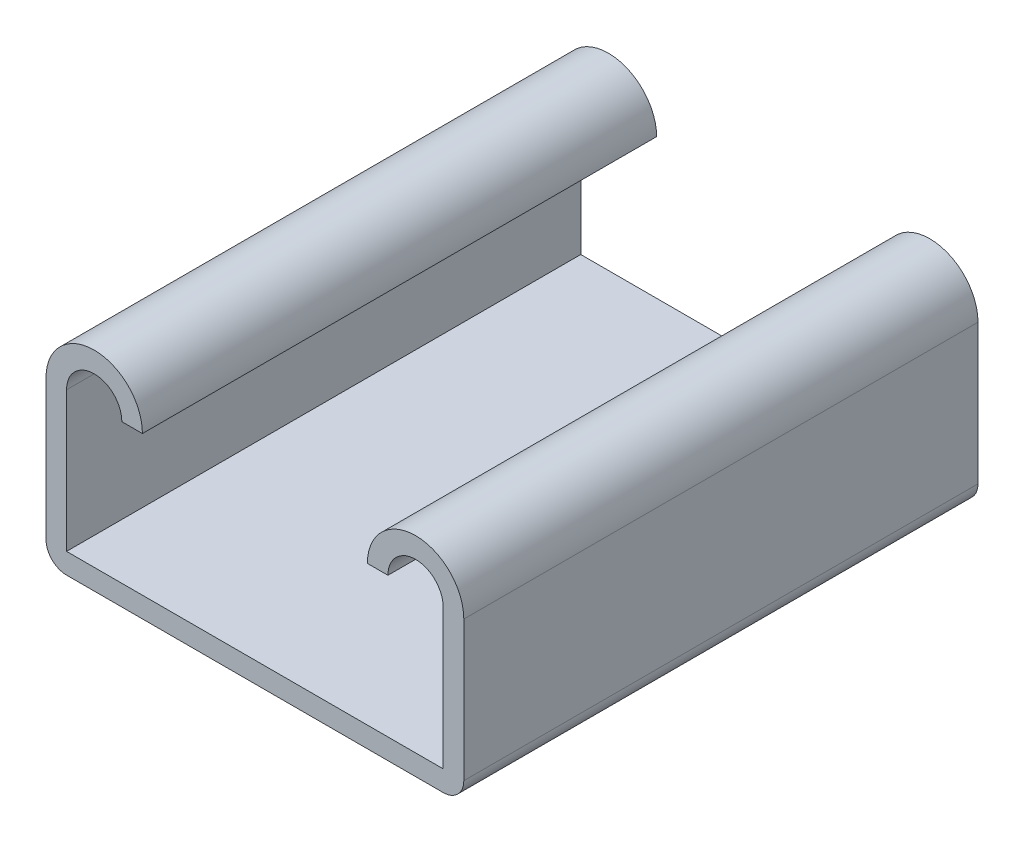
from build123d import *

# Parameters (mm, degrees)
BASE_EXTRUDE_DEPTH = 12.7


with BuildPart() as part:
    # Sketch1 → Base-Extrude (new, symmetric)
    with BuildSketch(Plane.XY):
        with BuildLine():
            Line((-10.31875, 3.79095), (-10.31875, -3.1242))
            ThreePointArc((-10.31875, -3.1242), (-10.02117049, -3.84262049), (-9.30275, -4.1402))
            Line((-9.30275, -4.1402), (9.30275, -4.1402))
            ThreePointArc((9.30275, -4.1402), (10.02117049, -3.84262049), (10.31875, -3.1242))
            Line((10.31875, -3.1242), (10.31875, 3.79095))
            ThreePointArc((10.31875, 3.79095), (7.9375, 6.1722), (5.55625, 3.79095))
            Line((5.55625, 3.79095), (6.57225, 3.79095))
            ThreePointArc((6.57225, 3.79095), (7.9375, 5.1562), (9.30275, 3.79095))
            Line((9.30275, 3.79095), (9.30275, -3.1242))
            Line((9.30275, -3.1242), (-9.30275, -3.1242))
            Line((-9.30275, -3.1242), (-9.30275, 3.79095))
            ThreePointArc((-9.30275, 3.79095), (-7.9375, 5.1562), (-6.57225, 3.79095))
            Line((-6.57225, 3.79095), (-5.55625, 3.79095))
            ThreePointArc((-5.55625, 3.79095), (-7.9375, 6.1722), (-10.31875, 3.79095))
        make_face()
    extrude(amount=BASE_EXTRUDE_DEPTH, both=True)


solid = part.part
